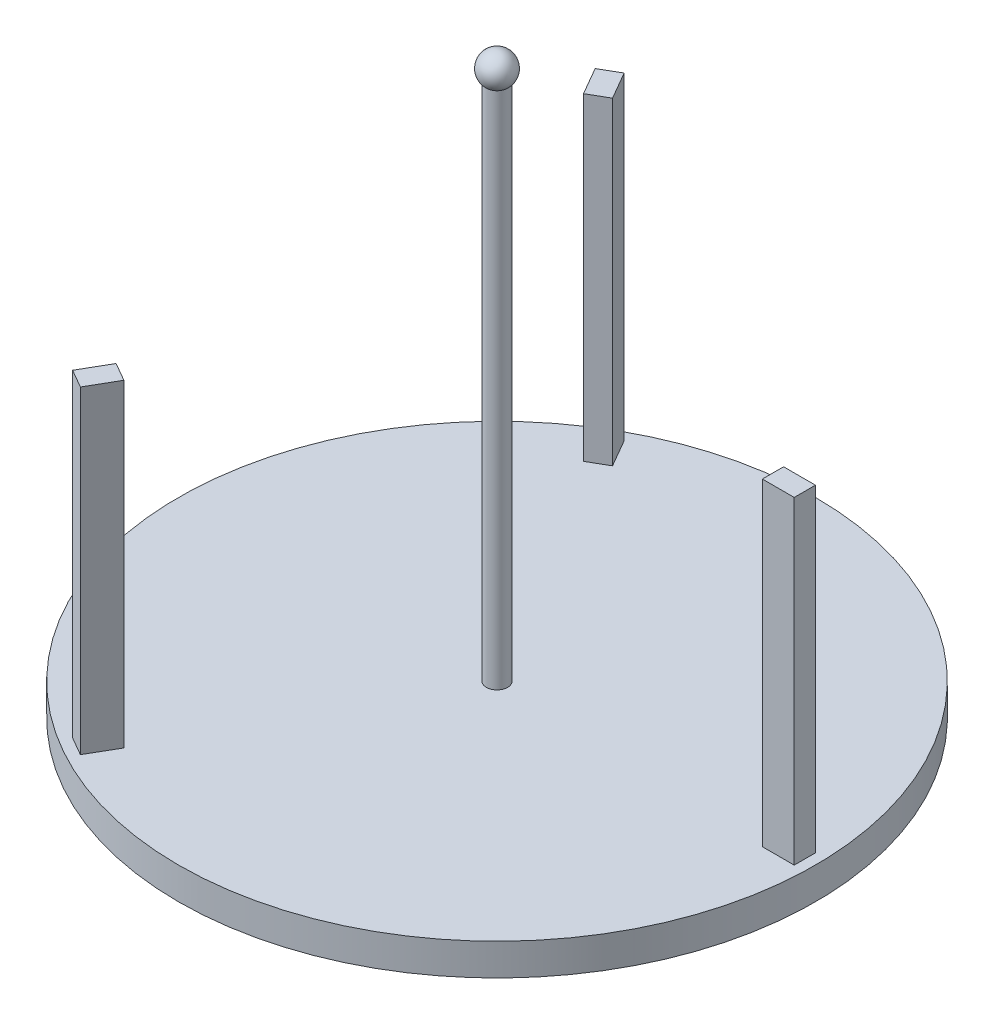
ISO-10303-21;
HEADER;
FILE_DESCRIPTION(('STEP AP214'),'2;1');
FILE_NAME('part.step','',(''),(''),'','','');
FILE_SCHEMA(('AUTOMOTIVE_DESIGN { 1 0 10303 214 1 1 1 1 }'));
ENDSEC;
DATA;
#1=APPLICATION_CONTEXT('core data for automotive mechanical design processes');
#2=APPLICATION_PROTOCOL_DEFINITION('international standard','automotive_design',2000,#1);
#3=PRODUCT_CONTEXT('',#1,'mechanical');
#4=PRODUCT('Part','Part','',(#3));
#5=PRODUCT_RELATED_PRODUCT_CATEGORY('part','',(#4));
#6=PRODUCT_DEFINITION_FORMATION('','',#4);
#7=PRODUCT_DEFINITION_CONTEXT('part definition',#1,'design');
#8=PRODUCT_DEFINITION('design','',#6,#7);
#9=PRODUCT_DEFINITION_SHAPE('','',#8);
#10=(LENGTH_UNIT() NAMED_UNIT(*) SI_UNIT(.MILLI.,.METRE.));
#11=(NAMED_UNIT(*) PLANE_ANGLE_UNIT() SI_UNIT($,.RADIAN.));
#12=(NAMED_UNIT(*) SI_UNIT($,.STERADIAN.) SOLID_ANGLE_UNIT());
#13=UNCERTAINTY_MEASURE_WITH_UNIT(LENGTH_MEASURE(1.E-05),#10,'distance_accuracy_value','');
#14=(GEOMETRIC_REPRESENTATION_CONTEXT(3) GLOBAL_UNCERTAINTY_ASSIGNED_CONTEXT((#13)) GLOBAL_UNIT_ASSIGNED_CONTEXT((#10,
#11,#12)) REPRESENTATION_CONTEXT('',''));
#15=CARTESIAN_POINT('',(0.,0.,0.));
#16=DIRECTION('',(0.,0.,1.));
#17=DIRECTION('',(1.,0.,0.));
#18=AXIS2_PLACEMENT_3D('',#15,#16,#17);
#19=CARTESIAN_POINT('',(0.,530.,0.));
#20=DIRECTION('',(0.,-1.,0.));
#21=DIRECTION('',(0.,0.,-1.));
#22=AXIS2_PLACEMENT_3D('',#19,#20,#21);
#23=CYLINDRICAL_SURFACE('',#22,10.);
#24=CARTESIAN_POINT('',(0.,30.,0.));
#25=DIRECTION('',(0.,1.,0.));
#26=DIRECTION('',(0.,0.,1.));
#27=AXIS2_PLACEMENT_3D('',#24,#25,#26);
#28=CIRCLE('',#27,10.);
#29=CARTESIAN_POINT('',(0.,30.,10.));
#30=VERTEX_POINT('',#29);
#31=EDGE_CURVE('E225',#30,#30,#28,.T.);
#32=ORIENTED_EDGE('',*,*,#31,.T.);
#33=EDGE_LOOP('',(#32));
#34=FACE_BOUND('',#33,.T.);
#35=CARTESIAN_POINT('',(0.,518.819660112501,0.));
#36=DIRECTION('',(0.,1.,0.));
#37=DIRECTION('',(0.,0.,1.));
#38=AXIS2_PLACEMENT_3D('',#35,#36,#37);
#39=CIRCLE('',#38,10.);
#40=CARTESIAN_POINT('',(0.,518.819660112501,10.));
#41=VERTEX_POINT('',#40);
#42=EDGE_CURVE('E11',#41,#41,#39,.T.);
#43=ORIENTED_EDGE('',*,*,#42,.F.);
#44=EDGE_LOOP('',(#43));
#45=FACE_BOUND('',#44,.T.);
#46=ADVANCED_FACE('F33',(#34,#45),#23,.T.);
#47=CARTESIAN_POINT('',(0.,30.,0.));
#48=DIRECTION('',(0.,1.,0.));
#49=DIRECTION('',(0.,0.,1.));
#50=AXIS2_PLACEMENT_3D('',#47,#48,#49);
#51=PLANE('',#50);
#52=DIRECTION('',(-0.499999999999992,0.,-0.866025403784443));
#53=VECTOR('',#52,1.);
#54=CARTESIAN_POINT('',(-121.339745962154,30.,-230.166604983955));
#55=LINE('',#54,#53);
#56=CARTESIAN_POINT('',(-121.339745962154,30.,-230.166604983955));
#57=VERTEX_POINT('',#56);
#58=CARTESIAN_POINT('',(-136.339745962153,30.,-256.147367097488));
#59=VERTEX_POINT('',#58);
#60=EDGE_CURVE('E228',#57,#59,#55,.T.);
#61=ORIENTED_EDGE('',*,*,#60,.F.);
#62=DIRECTION('',(0.866025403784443,0.,-0.499999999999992));
#63=VECTOR('',#62,1.);
#64=CARTESIAN_POINT('',(-121.339745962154,30.,-230.166604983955));
#65=LINE('',#64,#63);
#66=CARTESIAN_POINT('',(-138.660254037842,30.,-220.166604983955));
#67=VERTEX_POINT('',#66);
#68=EDGE_CURVE('E146',#67,#57,#65,.T.);
#69=ORIENTED_EDGE('',*,*,#68,.F.);
#70=DIRECTION('',(0.499999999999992,0.,0.866025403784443));
#71=VECTOR('',#70,1.);
#72=CARTESIAN_POINT('',(-138.660254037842,30.,-220.166604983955));
#73=LINE('',#72,#71);
#74=CARTESIAN_POINT('',(-153.660254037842,30.,-246.147367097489));
#75=VERTEX_POINT('',#74);
#76=EDGE_CURVE('E142',#75,#67,#73,.T.);
#77=ORIENTED_EDGE('',*,*,#76,.F.);
#78=DIRECTION('',(-0.866025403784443,0.,0.499999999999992));
#79=VECTOR('',#78,1.);
#80=CARTESIAN_POINT('',(-136.339745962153,30.,-256.147367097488));
#81=LINE('',#80,#79);
#82=EDGE_CURVE('E235',#59,#75,#81,.T.);
#83=ORIENTED_EDGE('',*,*,#82,.F.);
#84=EDGE_LOOP('',(#61,#69,#77,#83));
#85=FACE_BOUND('',#84,.T.);
#86=DIRECTION('',(1.,0.,0.));
#87=VECTOR('',#86,1.);
#88=CARTESIAN_POINT('',(260.,30.,9.99999999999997));
#89=LINE('',#88,#87);
#90=CARTESIAN_POINT('',(260.,30.,9.99999999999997));
#91=VERTEX_POINT('',#90);
#92=CARTESIAN_POINT('',(290.,30.,9.99999999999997));
#93=VERTEX_POINT('',#92);
#94=EDGE_CURVE('E193',#91,#93,#89,.T.);
#95=ORIENTED_EDGE('',*,*,#94,.F.);
#96=DIRECTION('',(0.,0.,1.));
#97=VECTOR('',#96,1.);
#98=CARTESIAN_POINT('',(260.,30.,9.99999999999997));
#99=LINE('',#98,#97);
#100=CARTESIAN_POINT('',(260.,30.,-10.));
#101=VERTEX_POINT('',#100);
#102=EDGE_CURVE('E179',#101,#91,#99,.T.);
#103=ORIENTED_EDGE('',*,*,#102,.F.);
#104=DIRECTION('',(-1.,0.,0.));
#105=VECTOR('',#104,1.);
#106=CARTESIAN_POINT('',(260.,30.,-10.));
#107=LINE('',#106,#105);
#108=CARTESIAN_POINT('',(290.,30.,-10.));
#109=VERTEX_POINT('',#108);
#110=EDGE_CURVE('E184',#109,#101,#107,.T.);
#111=ORIENTED_EDGE('',*,*,#110,.F.);
#112=DIRECTION('',(0.,0.,-1.));
#113=VECTOR('',#112,1.);
#114=CARTESIAN_POINT('',(290.,30.,9.99999999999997));
#115=LINE('',#114,#113);
#116=EDGE_CURVE('E195',#93,#109,#115,.T.);
#117=ORIENTED_EDGE('',*,*,#116,.F.);
#118=EDGE_LOOP('',(#95,#103,#111,#117));
#119=FACE_BOUND('',#118,.T.);
#120=CARTESIAN_POINT('',(0.,30.,0.));
#121=DIRECTION('',(0.,-1.,0.));
#122=DIRECTION('',(0.,0.,-1.));
#123=AXIS2_PLACEMENT_3D('',#120,#121,#122);
#124=CIRCLE('',#123,300.);
#125=CARTESIAN_POINT('',(0.,30.,-300.));
#126=VERTEX_POINT('',#125);
#127=EDGE_CURVE('E41',#126,#126,#124,.T.);
#128=ORIENTED_EDGE('',*,*,#127,.F.);
#129=EDGE_LOOP('',(#128));
#130=FACE_BOUND('',#129,.T.);
#131=DIRECTION('',(-0.500000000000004,0.,0.866025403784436));
#132=VECTOR('',#131,1.);
#133=CARTESIAN_POINT('',(-138.660254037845,30.,220.166604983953));
#134=LINE('',#133,#132);
#135=CARTESIAN_POINT('',(-138.660254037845,30.,220.166604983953));
#136=VERTEX_POINT('',#135);
#137=CARTESIAN_POINT('',(-153.660254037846,30.,246.147367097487));
#138=VERTEX_POINT('',#137);
#139=EDGE_CURVE('E151',#136,#138,#134,.T.);
#140=ORIENTED_EDGE('',*,*,#139,.F.);
#141=DIRECTION('',(-0.866025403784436,0.,-0.500000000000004));
#142=VECTOR('',#141,1.);
#143=CARTESIAN_POINT('',(-138.660254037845,30.,220.166604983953));
#144=LINE('',#143,#142);
#145=CARTESIAN_POINT('',(-121.339745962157,30.,230.166604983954));
#146=VERTEX_POINT('',#145);
#147=EDGE_CURVE('E148',#146,#136,#144,.T.);
#148=ORIENTED_EDGE('',*,*,#147,.F.);
#149=DIRECTION('',(0.500000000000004,0.,-0.866025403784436));
#150=VECTOR('',#149,1.);
#151=CARTESIAN_POINT('',(-121.339745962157,30.,230.166604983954));
#152=LINE('',#151,#150);
#153=CARTESIAN_POINT('',(-136.339745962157,30.,256.147367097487));
#154=VERTEX_POINT('',#153);
#155=EDGE_CURVE('E160',#154,#146,#152,.T.);
#156=ORIENTED_EDGE('',*,*,#155,.F.);
#157=DIRECTION('',(0.866025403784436,0.,0.500000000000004));
#158=VECTOR('',#157,1.);
#159=CARTESIAN_POINT('',(-153.660254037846,30.,246.147367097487));
#160=LINE('',#159,#158);
#161=EDGE_CURVE('E168',#138,#154,#160,.T.);
#162=ORIENTED_EDGE('',*,*,#161,.F.);
#163=EDGE_LOOP('',(#140,#148,#156,#162));
#164=FACE_BOUND('',#163,.T.);
#165=ORIENTED_EDGE('',*,*,#31,.F.);
#166=EDGE_LOOP('',(#165));
#167=FACE_BOUND('',#166,.T.);
#168=ADVANCED_FACE('F35',(#85,#119,#130,#164,#167),#51,.T.);
#169=CARTESIAN_POINT('',(0.,-34.9782122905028,0.));
#170=DIRECTION('',(0.,-1.,0.));
#171=DIRECTION('',(0.,0.,-1.));
#172=AXIS2_PLACEMENT_3D('',#169,#170,#171);
#173=CYLINDRICAL_SURFACE('',#172,300.);
#174=ORIENTED_EDGE('',*,*,#127,.T.);
#175=EDGE_LOOP('',(#174));
#176=FACE_BOUND('',#175,.T.);
#177=CARTESIAN_POINT('',(0.,0.,0.));
#178=DIRECTION('',(0.,-1.,0.));
#179=DIRECTION('',(0.,0.,-1.));
#180=AXIS2_PLACEMENT_3D('',#177,#178,#179);
#181=CIRCLE('',#180,300.);
#182=CARTESIAN_POINT('',(0.,0.,-300.));
#183=VERTEX_POINT('',#182);
#184=EDGE_CURVE('E208',#183,#183,#181,.T.);
#185=ORIENTED_EDGE('',*,*,#184,.F.);
#186=EDGE_LOOP('',(#185));
#187=FACE_BOUND('',#186,.T.);
#188=ADVANCED_FACE('F213',(#176,#187),#173,.T.);
#189=CARTESIAN_POINT('',(0.,0.,0.));
#190=DIRECTION('',(0.,-1.,0.));
#191=DIRECTION('',(0.,0.,-1.));
#192=AXIS2_PLACEMENT_3D('',#189,#190,#191);
#193=PLANE('',#192);
#194=ORIENTED_EDGE('',*,*,#184,.T.);
#195=EDGE_LOOP('',(#194));
#196=FACE_BOUND('',#195,.T.);
#197=ADVANCED_FACE('F291',(#196),#193,.T.);
#198=CARTESIAN_POINT('',(260.,330.,9.99999999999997));
#199=DIRECTION('',(1.,0.,0.));
#200=DIRECTION('',(0.,0.,-1.));
#201=AXIS2_PLACEMENT_3D('',#198,#199,#200);
#202=PLANE('',#201);
#203=ORIENTED_EDGE('',*,*,#102,.T.);
#204=DIRECTION('',(0.,-1.,0.));
#205=VECTOR('',#204,1.);
#206=CARTESIAN_POINT('',(260.,330.,9.99999999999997));
#207=LINE('',#206,#205);
#208=CARTESIAN_POINT('',(260.,330.,9.99999999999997));
#209=VERTEX_POINT('',#208);
#210=EDGE_CURVE('E206',#209,#91,#207,.T.);
#211=ORIENTED_EDGE('',*,*,#210,.F.);
#212=DIRECTION('',(0.,0.,1.));
#213=VECTOR('',#212,1.);
#214=CARTESIAN_POINT('',(260.,330.,9.99999999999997));
#215=LINE('',#214,#213);
#216=CARTESIAN_POINT('',(260.,330.,-10.));
#217=VERTEX_POINT('',#216);
#218=EDGE_CURVE('E180',#217,#209,#215,.T.);
#219=ORIENTED_EDGE('',*,*,#218,.F.);
#220=DIRECTION('',(0.,-1.,0.));
#221=VECTOR('',#220,1.);
#222=CARTESIAN_POINT('',(260.,330.,-10.));
#223=LINE('',#222,#221);
#224=EDGE_CURVE('E190',#217,#101,#223,.T.);
#225=ORIENTED_EDGE('',*,*,#224,.T.);
#226=EDGE_LOOP('',(#203,#211,#219,#225));
#227=FACE_BOUND('',#226,.T.);
#228=ADVANCED_FACE('F297',(#227),#202,.F.);
#229=CARTESIAN_POINT('',(260.,330.,9.99999999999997));
#230=DIRECTION('',(0.,0.,-1.));
#231=DIRECTION('',(-1.,0.,0.));
#232=AXIS2_PLACEMENT_3D('',#229,#230,#231);
#233=PLANE('',#232);
#234=ORIENTED_EDGE('',*,*,#94,.T.);
#235=DIRECTION('',(0.,-1.,0.));
#236=VECTOR('',#235,1.);
#237=CARTESIAN_POINT('',(290.,330.,9.99999999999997));
#238=LINE('',#237,#236);
#239=CARTESIAN_POINT('',(290.,330.,9.99999999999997));
#240=VERTEX_POINT('',#239);
#241=EDGE_CURVE('E203',#240,#93,#238,.T.);
#242=ORIENTED_EDGE('',*,*,#241,.F.);
#243=DIRECTION('',(1.,0.,0.));
#244=VECTOR('',#243,1.);
#245=CARTESIAN_POINT('',(260.,330.,9.99999999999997));
#246=LINE('',#245,#244);
#247=EDGE_CURVE('E183',#209,#240,#246,.T.);
#248=ORIENTED_EDGE('',*,*,#247,.F.);
#249=ORIENTED_EDGE('',*,*,#210,.T.);
#250=EDGE_LOOP('',(#234,#242,#248,#249));
#251=FACE_BOUND('',#250,.T.);
#252=ADVANCED_FACE('F305',(#251),#233,.F.);
#253=CARTESIAN_POINT('',(290.,330.,9.99999999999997));
#254=DIRECTION('',(-1.,0.,0.));
#255=DIRECTION('',(0.,0.,1.));
#256=AXIS2_PLACEMENT_3D('',#253,#254,#255);
#257=PLANE('',#256);
#258=ORIENTED_EDGE('',*,*,#116,.T.);
#259=DIRECTION('',(0.,-1.,0.));
#260=VECTOR('',#259,1.);
#261=CARTESIAN_POINT('',(290.,330.,-10.));
#262=LINE('',#261,#260);
#263=CARTESIAN_POINT('',(290.,330.,-10.));
#264=VERTEX_POINT('',#263);
#265=EDGE_CURVE('E201',#264,#109,#262,.T.);
#266=ORIENTED_EDGE('',*,*,#265,.F.);
#267=DIRECTION('',(0.,0.,-1.));
#268=VECTOR('',#267,1.);
#269=CARTESIAN_POINT('',(290.,330.,9.99999999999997));
#270=LINE('',#269,#268);
#271=EDGE_CURVE('E186',#240,#264,#270,.T.);
#272=ORIENTED_EDGE('',*,*,#271,.F.);
#273=ORIENTED_EDGE('',*,*,#241,.T.);
#274=EDGE_LOOP('',(#258,#266,#272,#273));
#275=FACE_BOUND('',#274,.T.);
#276=ADVANCED_FACE('F313',(#275),#257,.F.);
#277=CARTESIAN_POINT('',(260.,330.,-10.));
#278=DIRECTION('',(0.,0.,1.));
#279=DIRECTION('',(1.,0.,0.));
#280=AXIS2_PLACEMENT_3D('',#277,#278,#279);
#281=PLANE('',#280);
#282=ORIENTED_EDGE('',*,*,#110,.T.);
#283=ORIENTED_EDGE('',*,*,#224,.F.);
#284=DIRECTION('',(-1.,0.,0.));
#285=VECTOR('',#284,1.);
#286=CARTESIAN_POINT('',(260.,330.,-10.));
#287=LINE('',#286,#285);
#288=EDGE_CURVE('E188',#264,#217,#287,.T.);
#289=ORIENTED_EDGE('',*,*,#288,.F.);
#290=ORIENTED_EDGE('',*,*,#265,.T.);
#291=EDGE_LOOP('',(#282,#283,#289,#290));
#292=FACE_BOUND('',#291,.T.);
#293=ADVANCED_FACE('F321',(#292),#281,.F.);
#294=CARTESIAN_POINT('',(260.,330.,-10.));
#295=DIRECTION('',(0.,-1.,0.));
#296=DIRECTION('',(0.,0.,-1.));
#297=AXIS2_PLACEMENT_3D('',#294,#295,#296);
#298=PLANE('',#297);
#299=ORIENTED_EDGE('',*,*,#218,.T.);
#300=ORIENTED_EDGE('',*,*,#247,.T.);
#301=ORIENTED_EDGE('',*,*,#271,.T.);
#302=ORIENTED_EDGE('',*,*,#288,.T.);
#303=EDGE_LOOP('',(#299,#300,#301,#302));
#304=FACE_BOUND('',#303,.T.);
#305=ADVANCED_FACE('F329',(#304),#298,.F.);
#306=CARTESIAN_POINT('',(-138.660254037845,330.,220.166604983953));
#307=DIRECTION('',(-0.500000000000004,0.,0.866025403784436));
#308=DIRECTION('',(0.866025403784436,0.,0.500000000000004));
#309=AXIS2_PLACEMENT_3D('',#306,#307,#308);
#310=PLANE('',#309);
#311=ORIENTED_EDGE('',*,*,#147,.T.);
#312=DIRECTION('',(0.,-1.,0.));
#313=VECTOR('',#312,1.);
#314=CARTESIAN_POINT('',(-138.660254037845,330.,220.166604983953));
#315=LINE('',#314,#313);
#316=CARTESIAN_POINT('',(-138.660254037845,330.,220.166604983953));
#317=VERTEX_POINT('',#316);
#318=EDGE_CURVE('E177',#317,#136,#315,.T.);
#319=ORIENTED_EDGE('',*,*,#318,.F.);
#320=DIRECTION('',(-0.866025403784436,0.,-0.500000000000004));
#321=VECTOR('',#320,1.);
#322=CARTESIAN_POINT('',(-138.660254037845,330.,220.166604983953));
#323=LINE('',#322,#321);
#324=CARTESIAN_POINT('',(-121.339745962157,330.,230.166604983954));
#325=VERTEX_POINT('',#324);
#326=EDGE_CURVE('E156',#325,#317,#323,.T.);
#327=ORIENTED_EDGE('',*,*,#326,.F.);
#328=DIRECTION('',(0.,-1.,0.));
#329=VECTOR('',#328,1.);
#330=CARTESIAN_POINT('',(-121.339745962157,330.,230.166604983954));
#331=LINE('',#330,#329);
#332=EDGE_CURVE('E165',#325,#146,#331,.T.);
#333=ORIENTED_EDGE('',*,*,#332,.T.);
#334=EDGE_LOOP('',(#311,#319,#327,#333));
#335=FACE_BOUND('',#334,.T.);
#336=ADVANCED_FACE('F337',(#335),#310,.F.);
#337=CARTESIAN_POINT('',(-138.660254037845,330.,220.166604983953));
#338=DIRECTION('',(0.866025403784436,0.,0.500000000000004));
#339=DIRECTION('',(0.500000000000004,0.,-0.866025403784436));
#340=AXIS2_PLACEMENT_3D('',#337,#338,#339);
#341=PLANE('',#340);
#342=ORIENTED_EDGE('',*,*,#139,.T.);
#343=DIRECTION('',(0.,-1.,0.));
#344=VECTOR('',#343,1.);
#345=CARTESIAN_POINT('',(-153.660254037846,330.,246.147367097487));
#346=LINE('',#345,#344);
#347=CARTESIAN_POINT('',(-153.660254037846,330.,246.147367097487));
#348=VERTEX_POINT('',#347);
#349=EDGE_CURVE('E174',#348,#138,#346,.T.);
#350=ORIENTED_EDGE('',*,*,#349,.F.);
#351=DIRECTION('',(-0.500000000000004,0.,0.866025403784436));
#352=VECTOR('',#351,1.);
#353=CARTESIAN_POINT('',(-138.660254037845,330.,220.166604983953));
#354=LINE('',#353,#352);
#355=EDGE_CURVE('E159',#317,#348,#354,.T.);
#356=ORIENTED_EDGE('',*,*,#355,.F.);
#357=ORIENTED_EDGE('',*,*,#318,.T.);
#358=EDGE_LOOP('',(#342,#350,#356,#357));
#359=FACE_BOUND('',#358,.T.);
#360=ADVANCED_FACE('F345',(#359),#341,.F.);
#361=CARTESIAN_POINT('',(-153.660254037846,330.,246.147367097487));
#362=DIRECTION('',(0.500000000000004,0.,-0.866025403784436));
#363=DIRECTION('',(-0.866025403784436,0.,-0.500000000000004));
#364=AXIS2_PLACEMENT_3D('',#361,#362,#363);
#365=PLANE('',#364);
#366=ORIENTED_EDGE('',*,*,#161,.T.);
#367=DIRECTION('',(0.,-1.,0.));
#368=VECTOR('',#367,1.);
#369=CARTESIAN_POINT('',(-136.339745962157,330.,256.147367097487));
#370=LINE('',#369,#368);
#371=CARTESIAN_POINT('',(-136.339745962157,330.,256.147367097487));
#372=VERTEX_POINT('',#371);
#373=EDGE_CURVE('E56',#372,#154,#370,.T.);
#374=ORIENTED_EDGE('',*,*,#373,.F.);
#375=DIRECTION('',(0.866025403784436,0.,0.500000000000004));
#376=VECTOR('',#375,1.);
#377=CARTESIAN_POINT('',(-153.660254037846,330.,246.147367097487));
#378=LINE('',#377,#376);
#379=EDGE_CURVE('E162',#348,#372,#378,.T.);
#380=ORIENTED_EDGE('',*,*,#379,.F.);
#381=ORIENTED_EDGE('',*,*,#349,.T.);
#382=EDGE_LOOP('',(#366,#374,#380,#381));
#383=FACE_BOUND('',#382,.T.);
#384=ADVANCED_FACE('F353',(#383),#365,.F.);
#385=CARTESIAN_POINT('',(-121.339745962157,330.,230.166604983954));
#386=DIRECTION('',(-0.866025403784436,0.,-0.500000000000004));
#387=DIRECTION('',(-0.500000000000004,0.,0.866025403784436));
#388=AXIS2_PLACEMENT_3D('',#385,#386,#387);
#389=PLANE('',#388);
#390=ORIENTED_EDGE('',*,*,#155,.T.);
#391=ORIENTED_EDGE('',*,*,#332,.F.);
#392=DIRECTION('',(0.500000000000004,0.,-0.866025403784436));
#393=VECTOR('',#392,1.);
#394=CARTESIAN_POINT('',(-121.339745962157,330.,230.166604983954));
#395=LINE('',#394,#393);
#396=EDGE_CURVE('E164',#372,#325,#395,.T.);
#397=ORIENTED_EDGE('',*,*,#396,.F.);
#398=ORIENTED_EDGE('',*,*,#373,.T.);
#399=EDGE_LOOP('',(#390,#391,#397,#398));
#400=FACE_BOUND('',#399,.T.);
#401=ADVANCED_FACE('F361',(#400),#389,.F.);
#402=CARTESIAN_POINT('',(-121.339745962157,330.,230.166604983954));
#403=DIRECTION('',(0.,-1.,0.));
#404=DIRECTION('',(0.866025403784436,0.,0.500000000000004));
#405=AXIS2_PLACEMENT_3D('',#402,#403,#404);
#406=PLANE('',#405);
#407=ORIENTED_EDGE('',*,*,#326,.T.);
#408=ORIENTED_EDGE('',*,*,#355,.T.);
#409=ORIENTED_EDGE('',*,*,#379,.T.);
#410=ORIENTED_EDGE('',*,*,#396,.T.);
#411=EDGE_LOOP('',(#407,#408,#409,#410));
#412=FACE_BOUND('',#411,.T.);
#413=ADVANCED_FACE('F369',(#412),#406,.F.);
#414=CARTESIAN_POINT('',(-121.339745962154,330.,-230.166604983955));
#415=DIRECTION('',(-0.499999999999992,0.,-0.866025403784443));
#416=DIRECTION('',(-0.866025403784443,0.,0.499999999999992));
#417=AXIS2_PLACEMENT_3D('',#414,#415,#416);
#418=PLANE('',#417);
#419=ORIENTED_EDGE('',*,*,#68,.T.);
#420=DIRECTION('',(0.,-1.,0.));
#421=VECTOR('',#420,1.);
#422=CARTESIAN_POINT('',(-121.339745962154,330.,-230.166604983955));
#423=LINE('',#422,#421);
#424=CARTESIAN_POINT('',(-121.339745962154,330.,-230.166604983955));
#425=VERTEX_POINT('',#424);
#426=EDGE_CURVE('E127',#425,#57,#423,.T.);
#427=ORIENTED_EDGE('',*,*,#426,.F.);
#428=DIRECTION('',(0.866025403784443,0.,-0.499999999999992));
#429=VECTOR('',#428,1.);
#430=CARTESIAN_POINT('',(-121.339745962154,330.,-230.166604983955));
#431=LINE('',#430,#429);
#432=CARTESIAN_POINT('',(-138.660254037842,330.,-220.166604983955));
#433=VERTEX_POINT('',#432);
#434=EDGE_CURVE('E134',#433,#425,#431,.T.);
#435=ORIENTED_EDGE('',*,*,#434,.F.);
#436=DIRECTION('',(0.,-1.,0.));
#437=VECTOR('',#436,1.);
#438=CARTESIAN_POINT('',(-138.660254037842,330.,-220.166604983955));
#439=LINE('',#438,#437);
#440=EDGE_CURVE('E232',#433,#67,#439,.T.);
#441=ORIENTED_EDGE('',*,*,#440,.T.);
#442=EDGE_LOOP('',(#419,#427,#435,#441));
#443=FACE_BOUND('',#442,.T.);
#444=ADVANCED_FACE('F144',(#443),#418,.F.);
#445=CARTESIAN_POINT('',(-121.339745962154,330.,-230.166604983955));
#446=DIRECTION('',(-0.866025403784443,0.,0.499999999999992));
#447=DIRECTION('',(0.499999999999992,0.,0.866025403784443));
#448=AXIS2_PLACEMENT_3D('',#445,#446,#447);
#449=PLANE('',#448);
#450=ORIENTED_EDGE('',*,*,#60,.T.);
#451=DIRECTION('',(0.,-1.,0.));
#452=VECTOR('',#451,1.);
#453=CARTESIAN_POINT('',(-136.339745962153,330.,-256.147367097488));
#454=LINE('',#453,#452);
#455=CARTESIAN_POINT('',(-136.339745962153,330.,-256.147367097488));
#456=VERTEX_POINT('',#455);
#457=EDGE_CURVE('E130',#456,#59,#454,.T.);
#458=ORIENTED_EDGE('',*,*,#457,.F.);
#459=DIRECTION('',(-0.499999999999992,0.,-0.866025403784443));
#460=VECTOR('',#459,1.);
#461=CARTESIAN_POINT('',(-121.339745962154,330.,-230.166604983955));
#462=LINE('',#461,#460);
#463=EDGE_CURVE('E123',#425,#456,#462,.T.);
#464=ORIENTED_EDGE('',*,*,#463,.F.);
#465=ORIENTED_EDGE('',*,*,#426,.T.);
#466=EDGE_LOOP('',(#450,#458,#464,#465));
#467=FACE_BOUND('',#466,.T.);
#468=ADVANCED_FACE('F125',(#467),#449,.F.);
#469=CARTESIAN_POINT('',(-136.339745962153,330.,-256.147367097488));
#470=DIRECTION('',(0.499999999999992,0.,0.866025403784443));
#471=DIRECTION('',(0.866025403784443,0.,-0.499999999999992));
#472=AXIS2_PLACEMENT_3D('',#469,#470,#471);
#473=PLANE('',#472);
#474=ORIENTED_EDGE('',*,*,#82,.T.);
#475=DIRECTION('',(0.,-1.,0.));
#476=VECTOR('',#475,1.);
#477=CARTESIAN_POINT('',(-153.660254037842,330.,-246.147367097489));
#478=LINE('',#477,#476);
#479=CARTESIAN_POINT('',(-153.660254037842,330.,-246.147367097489));
#480=VERTEX_POINT('',#479);
#481=EDGE_CURVE('E48',#480,#75,#478,.T.);
#482=ORIENTED_EDGE('',*,*,#481,.F.);
#483=DIRECTION('',(-0.866025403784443,0.,0.499999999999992));
#484=VECTOR('',#483,1.);
#485=CARTESIAN_POINT('',(-136.339745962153,330.,-256.147367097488));
#486=LINE('',#485,#484);
#487=EDGE_CURVE('E133',#456,#480,#486,.T.);
#488=ORIENTED_EDGE('',*,*,#487,.F.);
#489=ORIENTED_EDGE('',*,*,#457,.T.);
#490=EDGE_LOOP('',(#474,#482,#488,#489));
#491=FACE_BOUND('',#490,.T.);
#492=ADVANCED_FACE('F242',(#491),#473,.F.);
#493=CARTESIAN_POINT('',(-138.660254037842,330.,-220.166604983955));
#494=DIRECTION('',(0.866025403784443,0.,-0.499999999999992));
#495=DIRECTION('',(-0.499999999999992,0.,-0.866025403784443));
#496=AXIS2_PLACEMENT_3D('',#493,#494,#495);
#497=PLANE('',#496);
#498=ORIENTED_EDGE('',*,*,#76,.T.);
#499=ORIENTED_EDGE('',*,*,#440,.F.);
#500=DIRECTION('',(0.499999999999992,0.,0.866025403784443));
#501=VECTOR('',#500,1.);
#502=CARTESIAN_POINT('',(-138.660254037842,330.,-220.166604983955));
#503=LINE('',#502,#501);
#504=EDGE_CURVE('E138',#480,#433,#503,.T.);
#505=ORIENTED_EDGE('',*,*,#504,.F.);
#506=ORIENTED_EDGE('',*,*,#481,.T.);
#507=EDGE_LOOP('',(#498,#499,#505,#506));
#508=FACE_BOUND('',#507,.T.);
#509=ADVANCED_FACE('F243',(#508),#497,.F.);
#510=CARTESIAN_POINT('',(-138.660254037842,330.,-220.166604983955));
#511=DIRECTION('',(0.,-1.,0.));
#512=DIRECTION('',(-0.866025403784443,0.,0.499999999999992));
#513=AXIS2_PLACEMENT_3D('',#510,#511,#512);
#514=PLANE('',#513);
#515=ORIENTED_EDGE('',*,*,#434,.T.);
#516=ORIENTED_EDGE('',*,*,#463,.T.);
#517=ORIENTED_EDGE('',*,*,#487,.T.);
#518=ORIENTED_EDGE('',*,*,#504,.T.);
#519=EDGE_LOOP('',(#515,#516,#517,#518));
#520=FACE_BOUND('',#519,.T.);
#521=ADVANCED_FACE('F137',(#520),#514,.F.);
#522=CARTESIAN_POINT('',(0.,530.,0.));
#523=DIRECTION('',(0.,-1.,0.));
#524=DIRECTION('',(-1.,0.,0.));
#525=AXIS2_PLACEMENT_3D('',#522,#523,#524);
#526=SPHERICAL_SURFACE('',#525,15.);
#527=ORIENTED_EDGE('',*,*,#42,.T.);
#528=EDGE_LOOP('',(#527));
#529=FACE_BOUND('',#528,.T.);
#530=ADVANCED_FACE('F250',(#529),#526,.T.);
#531=CLOSED_SHELL('',(#46,#168,#188,#197,#228,#252,#276,#293,#305,#336,#360,#384,#401,#413,#444,
#468,#492,#509,#521,#530));
#532=MANIFOLD_SOLID_BREP('B2',#531);
#533=ADVANCED_BREP_SHAPE_REPRESENTATION('',(#18,#532),#14);
#534=SHAPE_DEFINITION_REPRESENTATION(#9,#533);
ENDSEC;
END-ISO-10303-21;
